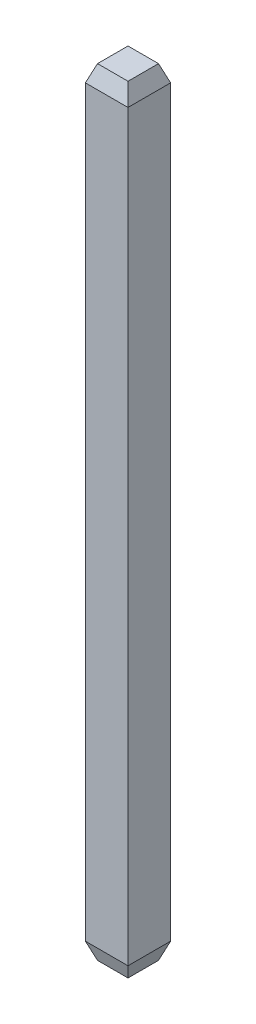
ISO-10303-21;
HEADER;
FILE_DESCRIPTION(('STEP AP214'),'2;1');
FILE_NAME('part.step','',(''),(''),'','','');
FILE_SCHEMA(('AUTOMOTIVE_DESIGN { 1 0 10303 214 1 1 1 1 }'));
ENDSEC;
DATA;
#1=APPLICATION_CONTEXT('core data for automotive mechanical design processes');
#2=APPLICATION_PROTOCOL_DEFINITION('international standard','automotive_design',2000,#1);
#3=PRODUCT_CONTEXT('',#1,'mechanical');
#4=PRODUCT('Part','Part','',(#3));
#5=PRODUCT_RELATED_PRODUCT_CATEGORY('part','',(#4));
#6=PRODUCT_DEFINITION_FORMATION('','',#4);
#7=PRODUCT_DEFINITION_CONTEXT('part definition',#1,'design');
#8=PRODUCT_DEFINITION('design','',#6,#7);
#9=PRODUCT_DEFINITION_SHAPE('','',#8);
#10=(LENGTH_UNIT() NAMED_UNIT(*) SI_UNIT(.MILLI.,.METRE.));
#11=(NAMED_UNIT(*) PLANE_ANGLE_UNIT() SI_UNIT($,.RADIAN.));
#12=(NAMED_UNIT(*) SI_UNIT($,.STERADIAN.) SOLID_ANGLE_UNIT());
#13=UNCERTAINTY_MEASURE_WITH_UNIT(LENGTH_MEASURE(1.E-05),#10,'distance_accuracy_value','');
#14=(GEOMETRIC_REPRESENTATION_CONTEXT(3) GLOBAL_UNCERTAINTY_ASSIGNED_CONTEXT((#13)) GLOBAL_UNIT_ASSIGNED_CONTEXT((#10,
#11,#12)) REPRESENTATION_CONTEXT('',''));
#15=CARTESIAN_POINT('',(0.,0.,0.));
#16=DIRECTION('',(0.,0.,1.));
#17=DIRECTION('',(1.,0.,0.));
#18=AXIS2_PLACEMENT_3D('',#15,#16,#17);
#19=CARTESIAN_POINT('',(0.32,11.66,0.32));
#20=DIRECTION('',(-1.,0.,0.));
#21=DIRECTION('',(0.,0.,1.));
#22=AXIS2_PLACEMENT_3D('',#19,#20,#21);
#23=PLANE('',#22);
#24=DIRECTION('',(0.,-1.,0.));
#25=VECTOR('',#24,1.);
#26=CARTESIAN_POINT('',(0.32,11.66,0.32));
#27=LINE('',#26,#25);
#28=CARTESIAN_POINT('',(0.32,11.41,0.32));
#29=VERTEX_POINT('',#28);
#30=CARTESIAN_POINT('',(0.32,0.250000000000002,0.32));
#31=VERTEX_POINT('',#30);
#32=EDGE_CURVE('E148',#29,#31,#27,.T.);
#33=ORIENTED_EDGE('',*,*,#32,.T.);
#34=DIRECTION('',(0.,0.,-1.));
#35=VECTOR('',#34,1.);
#36=CARTESIAN_POINT('',(0.32,0.250000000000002,-0.32));
#37=LINE('',#36,#35);
#38=CARTESIAN_POINT('',(0.32,0.250000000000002,-0.32));
#39=VERTEX_POINT('',#38);
#40=EDGE_CURVE('E11',#31,#39,#37,.T.);
#41=ORIENTED_EDGE('',*,*,#40,.T.);
#42=DIRECTION('',(0.,-1.,0.));
#43=VECTOR('',#42,1.);
#44=CARTESIAN_POINT('',(0.32,11.66,-0.32));
#45=LINE('',#44,#43);
#46=CARTESIAN_POINT('',(0.32,11.41,-0.32));
#47=VERTEX_POINT('',#46);
#48=EDGE_CURVE('E125',#47,#39,#45,.T.);
#49=ORIENTED_EDGE('',*,*,#48,.F.);
#50=DIRECTION('',(0.,0.,1.));
#51=VECTOR('',#50,1.);
#52=CARTESIAN_POINT('',(0.32,11.41,0.32));
#53=LINE('',#52,#51);
#54=EDGE_CURVE('E112',#47,#29,#53,.T.);
#55=ORIENTED_EDGE('',*,*,#54,.T.);
#56=EDGE_LOOP('',(#33,#41,#49,#55));
#57=FACE_BOUND('',#56,.T.);
#58=ADVANCED_FACE('F36',(#57),#23,.F.);
#59=CARTESIAN_POINT('',(-0.32,11.66,-0.32));
#60=DIRECTION('',(0.,0.,1.));
#61=DIRECTION('',(1.,0.,0.));
#62=AXIS2_PLACEMENT_3D('',#59,#60,#61);
#63=PLANE('',#62);
#64=ORIENTED_EDGE('',*,*,#48,.T.);
#65=DIRECTION('',(-1.,0.,0.));
#66=VECTOR('',#65,1.);
#67=CARTESIAN_POINT('',(-0.32,0.250000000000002,-0.32));
#68=LINE('',#67,#66);
#69=CARTESIAN_POINT('',(-0.32,0.250000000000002,-0.32));
#70=VERTEX_POINT('',#69);
#71=EDGE_CURVE('E141',#39,#70,#68,.T.);
#72=ORIENTED_EDGE('',*,*,#71,.T.);
#73=DIRECTION('',(0.,-1.,0.));
#74=VECTOR('',#73,1.);
#75=CARTESIAN_POINT('',(-0.32,11.66,-0.32));
#76=LINE('',#75,#74);
#77=CARTESIAN_POINT('',(-0.32,11.41,-0.32));
#78=VERTEX_POINT('',#77);
#79=EDGE_CURVE('E191',#78,#70,#76,.T.);
#80=ORIENTED_EDGE('',*,*,#79,.F.);
#81=DIRECTION('',(1.,0.,0.));
#82=VECTOR('',#81,1.);
#83=CARTESIAN_POINT('',(-0.32,11.41,-0.32));
#84=LINE('',#83,#82);
#85=EDGE_CURVE('E140',#78,#47,#84,.T.);
#86=ORIENTED_EDGE('',*,*,#85,.T.);
#87=EDGE_LOOP('',(#64,#72,#80,#86));
#88=FACE_BOUND('',#87,.T.);
#89=ADVANCED_FACE('F190',(#88),#63,.F.);
#90=CARTESIAN_POINT('',(-0.32,11.66,0.32));
#91=DIRECTION('',(1.,0.,0.));
#92=DIRECTION('',(0.,0.,-1.));
#93=AXIS2_PLACEMENT_3D('',#90,#91,#92);
#94=PLANE('',#93);
#95=ORIENTED_EDGE('',*,*,#79,.T.);
#96=DIRECTION('',(0.,0.,1.));
#97=VECTOR('',#96,1.);
#98=CARTESIAN_POINT('',(-0.32,0.250000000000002,0.32));
#99=LINE('',#98,#97);
#100=CARTESIAN_POINT('',(-0.32,0.250000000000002,0.32));
#101=VERTEX_POINT('',#100);
#102=EDGE_CURVE('E61',#70,#101,#99,.T.);
#103=ORIENTED_EDGE('',*,*,#102,.T.);
#104=DIRECTION('',(0.,-1.,0.));
#105=VECTOR('',#104,1.);
#106=CARTESIAN_POINT('',(-0.32,11.66,0.32));
#107=LINE('',#106,#105);
#108=CARTESIAN_POINT('',(-0.32,11.41,0.32));
#109=VERTEX_POINT('',#108);
#110=EDGE_CURVE('E195',#109,#101,#107,.T.);
#111=ORIENTED_EDGE('',*,*,#110,.F.);
#112=DIRECTION('',(0.,0.,-1.));
#113=VECTOR('',#112,1.);
#114=CARTESIAN_POINT('',(-0.32,11.41,0.32));
#115=LINE('',#114,#113);
#116=EDGE_CURVE('E138',#109,#78,#115,.T.);
#117=ORIENTED_EDGE('',*,*,#116,.T.);
#118=EDGE_LOOP('',(#95,#103,#111,#117));
#119=FACE_BOUND('',#118,.T.);
#120=ADVANCED_FACE('F193',(#119),#94,.F.);
#121=CARTESIAN_POINT('',(-0.32,11.66,0.32));
#122=DIRECTION('',(0.,0.,-1.));
#123=DIRECTION('',(-1.,0.,0.));
#124=AXIS2_PLACEMENT_3D('',#121,#122,#123);
#125=PLANE('',#124);
#126=ORIENTED_EDGE('',*,*,#110,.T.);
#127=DIRECTION('',(1.,0.,0.));
#128=VECTOR('',#127,1.);
#129=CARTESIAN_POINT('',(0.32,0.250000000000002,0.32));
#130=LINE('',#129,#128);
#131=EDGE_CURVE('E46',#101,#31,#130,.T.);
#132=ORIENTED_EDGE('',*,*,#131,.T.);
#133=ORIENTED_EDGE('',*,*,#32,.F.);
#134=DIRECTION('',(-1.,0.,0.));
#135=VECTOR('',#134,1.);
#136=CARTESIAN_POINT('',(-0.32,11.41,0.32));
#137=LINE('',#136,#135);
#138=EDGE_CURVE('E132',#29,#109,#137,.T.);
#139=ORIENTED_EDGE('',*,*,#138,.T.);
#140=EDGE_LOOP('',(#126,#132,#133,#139));
#141=FACE_BOUND('',#140,.T.);
#142=ADVANCED_FACE('F207',(#141),#125,.F.);
#143=CARTESIAN_POINT('',(0.,11.66,0.));
#144=DIRECTION('',(0.,-1.,0.));
#145=DIRECTION('',(0.,0.,-1.));
#146=AXIS2_PLACEMENT_3D('',#143,#144,#145);
#147=PLANE('',#146);
#148=DIRECTION('',(1.,0.,0.));
#149=VECTOR('',#148,1.);
#150=CARTESIAN_POINT('',(0.,11.66,0.229007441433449));
#151=LINE('',#150,#149);
#152=CARTESIAN_POINT('',(-0.229007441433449,11.66,0.229007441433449));
#153=VERTEX_POINT('',#152);
#154=CARTESIAN_POINT('',(0.229007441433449,11.66,0.229007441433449));
#155=VERTEX_POINT('',#154);
#156=EDGE_CURVE('E129',#153,#155,#151,.T.);
#157=ORIENTED_EDGE('',*,*,#156,.T.);
#158=DIRECTION('',(0.,0.,-1.));
#159=VECTOR('',#158,1.);
#160=CARTESIAN_POINT('',(0.229007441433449,11.66,0.));
#161=LINE('',#160,#159);
#162=CARTESIAN_POINT('',(0.229007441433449,11.66,-0.229007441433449));
#163=VERTEX_POINT('',#162);
#164=EDGE_CURVE('E110',#155,#163,#161,.T.);
#165=ORIENTED_EDGE('',*,*,#164,.T.);
#166=DIRECTION('',(-1.,0.,0.));
#167=VECTOR('',#166,1.);
#168=CARTESIAN_POINT('',(0.,11.66,-0.229007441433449));
#169=LINE('',#168,#167);
#170=CARTESIAN_POINT('',(-0.229007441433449,11.66,-0.229007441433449));
#171=VERTEX_POINT('',#170);
#172=EDGE_CURVE('E118',#163,#171,#169,.T.);
#173=ORIENTED_EDGE('',*,*,#172,.T.);
#174=DIRECTION('',(0.,0.,1.));
#175=VECTOR('',#174,1.);
#176=CARTESIAN_POINT('',(-0.229007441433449,11.66,0.));
#177=LINE('',#176,#175);
#178=EDGE_CURVE('E124',#171,#153,#177,.T.);
#179=ORIENTED_EDGE('',*,*,#178,.T.);
#180=EDGE_LOOP('',(#157,#165,#173,#179));
#181=FACE_BOUND('',#180,.T.);
#182=ADVANCED_FACE('F127',(#181),#147,.F.);
#183=CARTESIAN_POINT('',(0.,0.,0.));
#184=DIRECTION('',(0.,-1.,0.));
#185=DIRECTION('',(0.,0.,-1.));
#186=AXIS2_PLACEMENT_3D('',#183,#184,#185);
#187=PLANE('',#186);
#188=DIRECTION('',(0.,0.,-1.));
#189=VECTOR('',#188,1.);
#190=CARTESIAN_POINT('',(-0.229007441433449,0.,-0.32));
#191=LINE('',#190,#189);
#192=CARTESIAN_POINT('',(-0.229007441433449,0.,0.229007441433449));
#193=VERTEX_POINT('',#192);
#194=CARTESIAN_POINT('',(-0.229007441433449,0.,-0.229007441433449));
#195=VERTEX_POINT('',#194);
#196=EDGE_CURVE('E155',#193,#195,#191,.T.);
#197=ORIENTED_EDGE('',*,*,#196,.T.);
#198=DIRECTION('',(1.,0.,0.));
#199=VECTOR('',#198,1.);
#200=CARTESIAN_POINT('',(0.32,0.,-0.229007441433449));
#201=LINE('',#200,#199);
#202=CARTESIAN_POINT('',(0.229007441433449,0.,-0.229007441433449));
#203=VERTEX_POINT('',#202);
#204=EDGE_CURVE('E157',#195,#203,#201,.T.);
#205=ORIENTED_EDGE('',*,*,#204,.T.);
#206=DIRECTION('',(0.,0.,1.));
#207=VECTOR('',#206,1.);
#208=CARTESIAN_POINT('',(0.229007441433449,0.,0.32));
#209=LINE('',#208,#207);
#210=CARTESIAN_POINT('',(0.229007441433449,0.,0.229007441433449));
#211=VERTEX_POINT('',#210);
#212=EDGE_CURVE('E151',#203,#211,#209,.T.);
#213=ORIENTED_EDGE('',*,*,#212,.T.);
#214=DIRECTION('',(-1.,0.,0.));
#215=VECTOR('',#214,1.);
#216=CARTESIAN_POINT('',(-0.32,0.,0.229007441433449));
#217=LINE('',#216,#215);
#218=EDGE_CURVE('E153',#211,#193,#217,.T.);
#219=ORIENTED_EDGE('',*,*,#218,.T.);
#220=EDGE_LOOP('',(#197,#205,#213,#219));
#221=FACE_BOUND('',#220,.T.);
#222=ADVANCED_FACE('F180',(#221),#187,.T.);
#223=CARTESIAN_POINT('',(-0.229007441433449,11.66,0.));
#224=DIRECTION('',(0.939692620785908,-0.342020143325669,0.));
#225=DIRECTION('',(0.,0.,1.));
#226=AXIS2_PLACEMENT_3D('',#223,#224,#225);
#227=PLANE('',#226);
#228=DIRECTION('',(0.323615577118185,0.889126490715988,0.323615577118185));
#229=VECTOR('',#228,1.);
#230=CARTESIAN_POINT('',(-0.205024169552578,11.7258934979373,-0.205024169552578));
#231=LINE('',#230,#229);
#232=EDGE_CURVE('E121',#78,#171,#231,.T.);
#233=ORIENTED_EDGE('',*,*,#232,.F.);
#234=ORIENTED_EDGE('',*,*,#116,.F.);
#235=DIRECTION('',(0.323615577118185,0.889126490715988,-0.323615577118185));
#236=VECTOR('',#235,1.);
#237=CARTESIAN_POINT('',(-0.205024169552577,11.7258934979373,0.205024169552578));
#238=LINE('',#237,#236);
#239=EDGE_CURVE('E145',#153,#109,#238,.F.);
#240=ORIENTED_EDGE('',*,*,#239,.F.);
#241=ORIENTED_EDGE('',*,*,#178,.F.);
#242=EDGE_LOOP('',(#233,#234,#240,#241));
#243=FACE_BOUND('',#242,.T.);
#244=ADVANCED_FACE('F202',(#243),#227,.F.);
#245=CARTESIAN_POINT('',(0.,11.66,0.229007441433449));
#246=DIRECTION('',(0.,-0.342020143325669,-0.939692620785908));
#247=DIRECTION('',(1.,0.,0.));
#248=AXIS2_PLACEMENT_3D('',#245,#246,#247);
#249=PLANE('',#248);
#250=ORIENTED_EDGE('',*,*,#239,.T.);
#251=ORIENTED_EDGE('',*,*,#138,.F.);
#252=DIRECTION('',(-0.323615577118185,0.889126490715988,-0.323615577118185));
#253=VECTOR('',#252,1.);
#254=CARTESIAN_POINT('',(0.205024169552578,11.7258934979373,0.205024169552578));
#255=LINE('',#254,#253);
#256=EDGE_CURVE('E115',#155,#29,#255,.F.);
#257=ORIENTED_EDGE('',*,*,#256,.F.);
#258=ORIENTED_EDGE('',*,*,#156,.F.);
#259=EDGE_LOOP('',(#250,#251,#257,#258));
#260=FACE_BOUND('',#259,.T.);
#261=ADVANCED_FACE('F205',(#260),#249,.F.);
#262=CARTESIAN_POINT('',(0.,11.66,-0.229007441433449));
#263=DIRECTION('',(0.,-0.342020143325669,0.939692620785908));
#264=DIRECTION('',(-1.,0.,0.));
#265=AXIS2_PLACEMENT_3D('',#262,#263,#264);
#266=PLANE('',#265);
#267=ORIENTED_EDGE('',*,*,#232,.T.);
#268=ORIENTED_EDGE('',*,*,#172,.F.);
#269=DIRECTION('',(0.323615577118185,-0.889126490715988,-0.323615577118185));
#270=VECTOR('',#269,1.);
#271=CARTESIAN_POINT('',(0.205024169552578,11.7258934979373,-0.205024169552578));
#272=LINE('',#271,#270);
#273=EDGE_CURVE('E106',#47,#163,#272,.F.);
#274=ORIENTED_EDGE('',*,*,#273,.F.);
#275=ORIENTED_EDGE('',*,*,#85,.F.);
#276=EDGE_LOOP('',(#267,#268,#274,#275));
#277=FACE_BOUND('',#276,.T.);
#278=ADVANCED_FACE('F119',(#277),#266,.F.);
#279=CARTESIAN_POINT('',(0.229007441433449,11.66,0.));
#280=DIRECTION('',(-0.939692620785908,-0.342020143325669,0.));
#281=DIRECTION('',(0.,0.,-1.));
#282=AXIS2_PLACEMENT_3D('',#279,#280,#281);
#283=PLANE('',#282);
#284=ORIENTED_EDGE('',*,*,#256,.T.);
#285=ORIENTED_EDGE('',*,*,#54,.F.);
#286=ORIENTED_EDGE('',*,*,#273,.T.);
#287=ORIENTED_EDGE('',*,*,#164,.F.);
#288=EDGE_LOOP('',(#284,#285,#286,#287));
#289=FACE_BOUND('',#288,.T.);
#290=ADVANCED_FACE('F108',(#289),#283,.F.);
#291=CARTESIAN_POINT('',(-0.32,0.250000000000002,0.32));
#292=DIRECTION('',(0.,-0.342020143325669,0.939692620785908));
#293=DIRECTION('',(-1.,0.,0.));
#294=AXIS2_PLACEMENT_3D('',#291,#292,#293);
#295=PLANE('',#294);
#296=DIRECTION('',(0.323615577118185,-0.889126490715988,-0.323615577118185));
#297=VECTOR('',#296,1.);
#298=CARTESIAN_POINT('',(-0.32,0.250000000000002,0.32));
#299=LINE('',#298,#297);
#300=EDGE_CURVE('E165',#193,#101,#299,.F.);
#301=ORIENTED_EDGE('',*,*,#300,.F.);
#302=ORIENTED_EDGE('',*,*,#218,.F.);
#303=DIRECTION('',(-0.323615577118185,-0.889126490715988,-0.323615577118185));
#304=VECTOR('',#303,1.);
#305=CARTESIAN_POINT('',(0.32,0.250000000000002,0.32));
#306=LINE('',#305,#304);
#307=EDGE_CURVE('E41',#31,#211,#306,.T.);
#308=ORIENTED_EDGE('',*,*,#307,.F.);
#309=ORIENTED_EDGE('',*,*,#131,.F.);
#310=EDGE_LOOP('',(#301,#302,#308,#309));
#311=FACE_BOUND('',#310,.T.);
#312=ADVANCED_FACE('F39',(#311),#295,.T.);
#313=CARTESIAN_POINT('',(0.32,0.250000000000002,0.32));
#314=DIRECTION('',(0.939692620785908,-0.342020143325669,0.));
#315=DIRECTION('',(0.,0.,1.));
#316=AXIS2_PLACEMENT_3D('',#313,#314,#315);
#317=PLANE('',#316);
#318=ORIENTED_EDGE('',*,*,#307,.T.);
#319=ORIENTED_EDGE('',*,*,#212,.F.);
#320=DIRECTION('',(0.323615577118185,0.889126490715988,-0.323615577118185));
#321=VECTOR('',#320,1.);
#322=CARTESIAN_POINT('',(0.252974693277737,0.0658494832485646,-0.252974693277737));
#323=LINE('',#322,#321);
#324=EDGE_CURVE('E164',#39,#203,#323,.F.);
#325=ORIENTED_EDGE('',*,*,#324,.F.);
#326=ORIENTED_EDGE('',*,*,#40,.F.);
#327=EDGE_LOOP('',(#318,#319,#325,#326));
#328=FACE_BOUND('',#327,.T.);
#329=ADVANCED_FACE('F175',(#328),#317,.T.);
#330=CARTESIAN_POINT('',(-0.32,0.250000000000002,0.32));
#331=DIRECTION('',(-0.939692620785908,-0.342020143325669,0.));
#332=DIRECTION('',(0.,0.,-1.));
#333=AXIS2_PLACEMENT_3D('',#330,#331,#332);
#334=PLANE('',#333);
#335=ORIENTED_EDGE('',*,*,#300,.T.);
#336=ORIENTED_EDGE('',*,*,#102,.F.);
#337=DIRECTION('',(0.323615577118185,-0.889126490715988,0.323615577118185));
#338=VECTOR('',#337,1.);
#339=CARTESIAN_POINT('',(-0.252974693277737,0.0658494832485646,-0.252974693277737));
#340=LINE('',#339,#338);
#341=EDGE_CURVE('E162',#195,#70,#340,.F.);
#342=ORIENTED_EDGE('',*,*,#341,.F.);
#343=ORIENTED_EDGE('',*,*,#196,.F.);
#344=EDGE_LOOP('',(#335,#336,#342,#343));
#345=FACE_BOUND('',#344,.T.);
#346=ADVANCED_FACE('F186',(#345),#334,.T.);
#347=CARTESIAN_POINT('',(-0.32,0.250000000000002,-0.32));
#348=DIRECTION('',(0.,-0.342020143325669,-0.939692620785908));
#349=DIRECTION('',(1.,0.,0.));
#350=AXIS2_PLACEMENT_3D('',#347,#348,#349);
#351=PLANE('',#350);
#352=ORIENTED_EDGE('',*,*,#324,.T.);
#353=ORIENTED_EDGE('',*,*,#204,.F.);
#354=ORIENTED_EDGE('',*,*,#341,.T.);
#355=ORIENTED_EDGE('',*,*,#71,.F.);
#356=EDGE_LOOP('',(#352,#353,#354,#355));
#357=FACE_BOUND('',#356,.T.);
#358=ADVANCED_FACE('F184',(#357),#351,.T.);
#359=CLOSED_SHELL('',(#58,#89,#120,#142,#182,#222,#244,#261,#278,#290,#312,#329,#346,#358));
#360=MANIFOLD_SOLID_BREP('B2',#359);
#361=ADVANCED_BREP_SHAPE_REPRESENTATION('',(#18,#360),#14);
#362=SHAPE_DEFINITION_REPRESENTATION(#9,#361);
ENDSEC;
END-ISO-10303-21;
